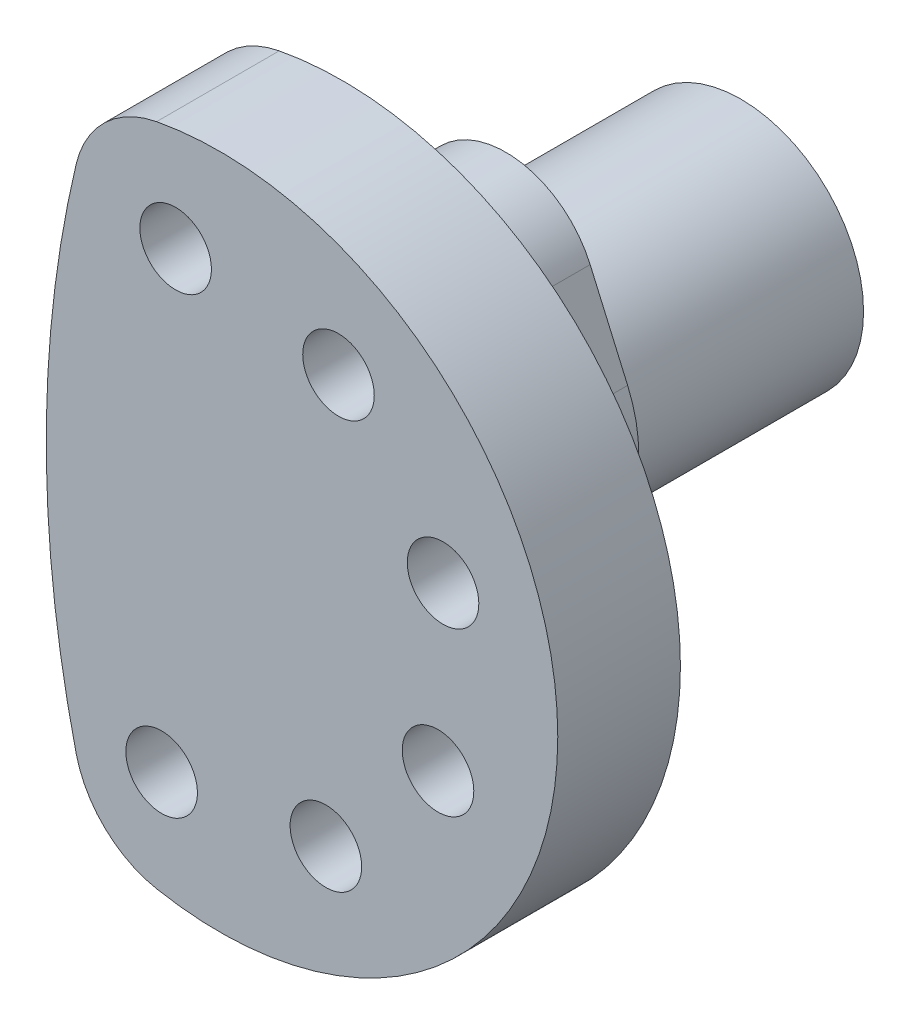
ISO-10303-21;
HEADER;
FILE_DESCRIPTION(('STEP AP214'),'2;1');
FILE_NAME('part.step','',(''),(''),'','','');
FILE_SCHEMA(('AUTOMOTIVE_DESIGN { 1 0 10303 214 1 1 1 1 }'));
ENDSEC;
DATA;
#1=APPLICATION_CONTEXT('core data for automotive mechanical design processes');
#2=APPLICATION_PROTOCOL_DEFINITION('international standard','automotive_design',2000,#1);
#3=PRODUCT_CONTEXT('',#1,'mechanical');
#4=PRODUCT('Part','Part','',(#3));
#5=PRODUCT_RELATED_PRODUCT_CATEGORY('part','',(#4));
#6=PRODUCT_DEFINITION_FORMATION('','',#4);
#7=PRODUCT_DEFINITION_CONTEXT('part definition',#1,'design');
#8=PRODUCT_DEFINITION('design','',#6,#7);
#9=PRODUCT_DEFINITION_SHAPE('','',#8);
#10=(LENGTH_UNIT() NAMED_UNIT(*) SI_UNIT(.MILLI.,.METRE.));
#11=(NAMED_UNIT(*) PLANE_ANGLE_UNIT() SI_UNIT($,.RADIAN.));
#12=(NAMED_UNIT(*) SI_UNIT($,.STERADIAN.) SOLID_ANGLE_UNIT());
#13=UNCERTAINTY_MEASURE_WITH_UNIT(LENGTH_MEASURE(1.E-05),#10,'distance_accuracy_value','');
#14=(GEOMETRIC_REPRESENTATION_CONTEXT(3) GLOBAL_UNCERTAINTY_ASSIGNED_CONTEXT((#13)) GLOBAL_UNIT_ASSIGNED_CONTEXT((#10,
#11,#12)) REPRESENTATION_CONTEXT('',''));
#15=CARTESIAN_POINT('',(0.,0.,0.));
#16=DIRECTION('',(0.,0.,1.));
#17=DIRECTION('',(1.,0.,0.));
#18=AXIS2_PLACEMENT_3D('',#15,#16,#17);
#19=CARTESIAN_POINT('',(0.,10.,-16.));
#20=DIRECTION('',(0.,0.,-1.));
#21=DIRECTION('',(-1.,0.,0.));
#22=AXIS2_PLACEMENT_3D('',#19,#20,#21);
#23=PLANE('',#22);
#24=DIRECTION('',(0.4,0.916515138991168,0.));
#25=VECTOR('',#24,1.);
#26=CARTESIAN_POINT('',(-11.9146968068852,5.2,-16.));
#27=LINE('',#26,#25);
#28=CARTESIAN_POINT('',(-11.9146968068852,5.2,-16.));
#29=VERTEX_POINT('',#28);
#30=CARTESIAN_POINT('',(-8.24863625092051,13.6,-16.));
#31=VERTEX_POINT('',#30);
#32=EDGE_CURVE('E118',#29,#31,#27,.T.);
#33=ORIENTED_EDGE('',*,*,#32,.T.);
#34=CARTESIAN_POINT('',(0.,10.,-16.));
#35=DIRECTION('',(0.,0.,-1.));
#36=DIRECTION('',(-1.,0.,0.));
#37=AXIS2_PLACEMENT_3D('',#34,#35,#36);
#38=CIRCLE('',#37,9.);
#39=CARTESIAN_POINT('',(8.24863625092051,13.6,-16.));
#40=VERTEX_POINT('',#39);
#41=EDGE_CURVE('E108',#31,#40,#38,.T.);
#42=ORIENTED_EDGE('',*,*,#41,.T.);
#43=DIRECTION('',(0.4,-0.916515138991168,0.));
#44=VECTOR('',#43,1.);
#45=CARTESIAN_POINT('',(8.24863625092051,13.6,-16.));
#46=LINE('',#45,#44);
#47=CARTESIAN_POINT('',(11.9146968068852,5.2,-16.));
#48=VERTEX_POINT('',#47);
#49=EDGE_CURVE('E117',#40,#48,#46,.T.);
#50=ORIENTED_EDGE('',*,*,#49,.T.);
#51=CARTESIAN_POINT('',(0.,0.,-16.));
#52=DIRECTION('',(0.,0.,1.));
#53=DIRECTION('',(1.,0.,0.));
#54=AXIS2_PLACEMENT_3D('',#51,#52,#53);
#55=CIRCLE('',#54,13.);
#56=EDGE_CURVE('E124',#29,#48,#55,.T.);
#57=ORIENTED_EDGE('',*,*,#56,.F.);
#58=EDGE_LOOP('',(#33,#42,#50,#57));
#59=FACE_BOUND('',#58,.T.);
#60=CARTESIAN_POINT('',(0.,0.,-16.));
#61=DIRECTION('',(0.,0.,-1.));
#62=DIRECTION('',(-1.,0.,0.));
#63=AXIS2_PLACEMENT_3D('',#60,#61,#62);
#64=CIRCLE('',#63,12.);
#65=CARTESIAN_POINT('',(-12.,0.,-16.));
#66=VERTEX_POINT('',#65);
#67=EDGE_CURVE('E282',#66,#66,#64,.T.);
#68=ORIENTED_EDGE('',*,*,#67,.F.);
#69=EDGE_LOOP('',(#68));
#70=FACE_BOUND('',#69,.T.);
#71=ADVANCED_FACE('F33',(#59,#70),#23,.T.);
#72=CARTESIAN_POINT('',(43.3619993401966,-11.337872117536,0.));
#73=DIRECTION('',(0.,0.,1.));
#74=DIRECTION('',(1.,0.,0.));
#75=AXIS2_PLACEMENT_3D('',#72,#73,#74);
#76=PLANE('',#75);
#77=CARTESIAN_POINT('',(91.0322485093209,0.,0.));
#78=DIRECTION('',(0.,0.,1.));
#79=DIRECTION('',(1.,0.,0.));
#80=AXIS2_PLACEMENT_3D('',#77,#78,#79);
#81=CIRCLE('',#80,108.);
#82=CARTESIAN_POINT('',(-14.0368721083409,24.9895956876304,0.));
#83=VERTEX_POINT('',#82);
#84=CARTESIAN_POINT('',(-14.0368721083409,-24.9895956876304,0.));
#85=VERTEX_POINT('',#84);
#86=EDGE_CURVE('E171',#83,#85,#81,.T.);
#87=ORIENTED_EDGE('',*,*,#86,.F.);
#88=CARTESIAN_POINT('',(-4.30824982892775,22.675744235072,0.));
#89=DIRECTION('',(0.,0.,1.));
#90=DIRECTION('',(-1.,0.,0.));
#91=AXIS2_PLACEMENT_3D('',#88,#89,#90);
#92=CIRCLE('',#91,9.99999999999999);
#93=CARTESIAN_POINT('',(-6.17479708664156,32.5,0.));
#94=VERTEX_POINT('',#93);
#95=EDGE_CURVE('E78',#94,#83,#92,.T.);
#96=ORIENTED_EDGE('',*,*,#95,.F.);
#97=CARTESIAN_POINT('',(0.,0.,0.));
#98=DIRECTION('',(0.,0.,1.));
#99=DIRECTION('',(1.,0.,0.));
#100=AXIS2_PLACEMENT_3D('',#97,#98,#99);
#101=CIRCLE('',#100,33.081386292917);
#102=CARTESIAN_POINT('',(-6.17479708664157,-32.5,0.));
#103=VERTEX_POINT('',#102);
#104=EDGE_CURVE('E185',#103,#94,#101,.T.);
#105=ORIENTED_EDGE('',*,*,#104,.F.);
#106=CARTESIAN_POINT('',(-4.30824982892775,-22.675744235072,0.));
#107=DIRECTION('',(0.,0.,1.));
#108=DIRECTION('',(1.,0.,0.));
#109=AXIS2_PLACEMENT_3D('',#106,#107,#108);
#110=CIRCLE('',#109,10.);
#111=EDGE_CURVE('E183',#85,#103,#110,.T.);
#112=ORIENTED_EDGE('',*,*,#111,.F.);
#113=EDGE_LOOP('',(#87,#96,#105,#112));
#114=FACE_BOUND('',#113,.T.);
#115=CARTESIAN_POINT('',(-4.30824982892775,22.675744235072,0.));
#116=DIRECTION('',(0.,0.,-1.));
#117=DIRECTION('',(-1.,0.,0.));
#118=AXIS2_PLACEMENT_3D('',#115,#116,#117);
#119=CIRCLE('',#118,3.5);
#120=CARTESIAN_POINT('',(-7.80824982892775,22.675744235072,0.));
#121=VERTEX_POINT('',#120);
#122=EDGE_CURVE('E168',#121,#121,#119,.T.);
#123=ORIENTED_EDGE('',*,*,#122,.F.);
#124=EDGE_LOOP('',(#123));
#125=FACE_BOUND('',#124,.T.);
#126=CARTESIAN_POINT('',(11.6251493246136,19.940067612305,0.));
#127=DIRECTION('',(0.,0.,-1.));
#128=DIRECTION('',(-0.754709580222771,0.656059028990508,0.));
#129=AXIS2_PLACEMENT_3D('',#126,#127,#128);
#130=CIRCLE('',#129,3.5);
#131=CARTESIAN_POINT('',(8.98366579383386,22.2362742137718,0.));
#132=VERTEX_POINT('',#131);
#133=EDGE_CURVE('E164',#132,#132,#130,.T.);
#134=ORIENTED_EDGE('',*,*,#133,.F.);
#135=EDGE_LOOP('',(#134));
#136=FACE_BOUND('',#135,.T.);
#137=CARTESIAN_POINT('',(21.85547296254,7.42217587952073,0.));
#138=DIRECTION('',(0.,0.,-1.));
#139=DIRECTION('',(-0.139173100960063,0.990268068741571,0.));
#140=AXIS2_PLACEMENT_3D('',#137,#138,#139);
#141=CIRCLE('',#140,3.5);
#142=CARTESIAN_POINT('',(21.3683671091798,10.8881141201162,0.));
#143=VERTEX_POINT('',#142);
#144=EDGE_CURVE('E158',#143,#143,#141,.T.);
#145=ORIENTED_EDGE('',*,*,#144,.F.);
#146=EDGE_LOOP('',(#145));
#147=FACE_BOUND('',#146,.T.);
#148=CARTESIAN_POINT('',(21.3639203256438,-8.73689312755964,0.));
#149=DIRECTION('',(0.,0.,-1.));
#150=DIRECTION('',(0.54463903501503,0.838670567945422,0.));
#151=AXIS2_PLACEMENT_3D('',#148,#149,#150);
#152=CIRCLE('',#151,3.5);
#153=CARTESIAN_POINT('',(23.2701569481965,-5.80154613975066,0.));
#154=VERTEX_POINT('',#153);
#155=EDGE_CURVE('E152',#154,#154,#152,.T.);
#156=ORIENTED_EDGE('',*,*,#155,.F.);
#157=EDGE_LOOP('',(#156));
#158=FACE_BOUND('',#157,.T.);
#159=CARTESIAN_POINT('',(10.3916377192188,-20.6098097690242,0.));
#160=DIRECTION('',(0.,0.,-1.));
#161=DIRECTION('',(0.96126169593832,0.275637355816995,0.));
#162=AXIS2_PLACEMENT_3D('',#159,#160,#161);
#163=CIRCLE('',#162,3.5);
#164=CARTESIAN_POINT('',(13.7560536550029,-19.6450790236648,0.));
#165=VERTEX_POINT('',#164);
#166=EDGE_CURVE('E146',#165,#165,#163,.T.);
#167=ORIENTED_EDGE('',*,*,#166,.F.);
#168=EDGE_LOOP('',(#167));
#169=FACE_BOUND('',#168,.T.);
#170=CARTESIAN_POINT('',(-5.67858324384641,-22.3719486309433,0.));
#171=DIRECTION('',(0.,0.,-1.));
#172=DIRECTION('',(0.906307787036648,-0.422618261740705,0.));
#173=AXIS2_PLACEMENT_3D('',#170,#171,#172);
#174=CIRCLE('',#173,3.5);
#175=CARTESIAN_POINT('',(-2.50650598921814,-23.8511125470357,0.));
#176=VERTEX_POINT('',#175);
#177=EDGE_CURVE('E135',#176,#176,#174,.T.);
#178=ORIENTED_EDGE('',*,*,#177,.F.);
#179=EDGE_LOOP('',(#178));
#180=FACE_BOUND('',#179,.T.);
#181=DIRECTION('',(0.4,0.916515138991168,0.));
#182=VECTOR('',#181,1.);
#183=CARTESIAN_POINT('',(-11.9146968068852,5.2,0.));
#184=LINE('',#183,#182);
#185=CARTESIAN_POINT('',(-11.9146968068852,5.2,0.));
#186=VERTEX_POINT('',#185);
#187=CARTESIAN_POINT('',(-8.24863625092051,13.6,0.));
#188=VERTEX_POINT('',#187);
#189=EDGE_CURVE('E130',#186,#188,#184,.T.);
#190=ORIENTED_EDGE('',*,*,#189,.F.);
#191=CARTESIAN_POINT('',(0.,0.,0.));
#192=DIRECTION('',(0.,0.,1.));
#193=DIRECTION('',(1.,0.,0.));
#194=AXIS2_PLACEMENT_3D('',#191,#192,#193);
#195=CIRCLE('',#194,13.);
#196=CARTESIAN_POINT('',(11.9146968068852,5.2,0.));
#197=VERTEX_POINT('',#196);
#198=EDGE_CURVE('E126',#186,#197,#195,.T.);
#199=ORIENTED_EDGE('',*,*,#198,.T.);
#200=DIRECTION('',(0.4,-0.916515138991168,0.));
#201=VECTOR('',#200,1.);
#202=CARTESIAN_POINT('',(8.24863625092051,13.6,0.));
#203=LINE('',#202,#201);
#204=CARTESIAN_POINT('',(8.24863625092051,13.6,0.));
#205=VERTEX_POINT('',#204);
#206=EDGE_CURVE('E48',#205,#197,#203,.T.);
#207=ORIENTED_EDGE('',*,*,#206,.F.);
#208=CARTESIAN_POINT('',(0.,10.,0.));
#209=DIRECTION('',(0.,0.,-1.));
#210=DIRECTION('',(-1.,0.,0.));
#211=AXIS2_PLACEMENT_3D('',#208,#209,#210);
#212=CIRCLE('',#211,9.);
#213=EDGE_CURVE('E277',#188,#205,#212,.T.);
#214=ORIENTED_EDGE('',*,*,#213,.F.);
#215=EDGE_LOOP('',(#190,#199,#207,#214));
#216=FACE_BOUND('',#215,.T.);
#217=ADVANCED_FACE('F198',(#114,#125,#136,#147,#158,#169,#180,#216),#76,.F.);
#218=CARTESIAN_POINT('',(91.0322485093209,0.,12.));
#219=DIRECTION('',(0.,0.,-1.));
#220=DIRECTION('',(-1.,0.,0.));
#221=AXIS2_PLACEMENT_3D('',#218,#219,#220);
#222=CYLINDRICAL_SURFACE('',#221,108.);
#223=ORIENTED_EDGE('',*,*,#86,.T.);
#224=DIRECTION('',(0.,0.,-1.));
#225=VECTOR('',#224,1.);
#226=CARTESIAN_POINT('',(-14.0368721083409,-24.9895956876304,12.));
#227=LINE('',#226,#225);
#228=CARTESIAN_POINT('',(-14.0368721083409,-24.9895956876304,12.));
#229=VERTEX_POINT('',#228);
#230=EDGE_CURVE('E11',#229,#85,#227,.T.);
#231=ORIENTED_EDGE('',*,*,#230,.F.);
#232=CARTESIAN_POINT('',(91.0322485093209,0.,12.));
#233=DIRECTION('',(0.,0.,1.));
#234=DIRECTION('',(1.,0.,0.));
#235=AXIS2_PLACEMENT_3D('',#232,#233,#234);
#236=CIRCLE('',#235,108.);
#237=CARTESIAN_POINT('',(-14.0368721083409,24.9895956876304,12.));
#238=VERTEX_POINT('',#237);
#239=EDGE_CURVE('E174',#238,#229,#236,.T.);
#240=ORIENTED_EDGE('',*,*,#239,.F.);
#241=DIRECTION('',(0.,0.,-1.));
#242=VECTOR('',#241,1.);
#243=CARTESIAN_POINT('',(-14.0368721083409,24.9895956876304,12.));
#244=LINE('',#243,#242);
#245=EDGE_CURVE('E180',#238,#83,#244,.T.);
#246=ORIENTED_EDGE('',*,*,#245,.T.);
#247=EDGE_LOOP('',(#223,#231,#240,#246));
#248=FACE_BOUND('',#247,.T.);
#249=ADVANCED_FACE('F35',(#248),#222,.T.);
#250=CARTESIAN_POINT('',(-4.30824982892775,-22.675744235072,12.));
#251=DIRECTION('',(0.,0.,-1.));
#252=DIRECTION('',(-1.,0.,0.));
#253=AXIS2_PLACEMENT_3D('',#250,#251,#252);
#254=CYLINDRICAL_SURFACE('',#253,10.);
#255=ORIENTED_EDGE('',*,*,#111,.T.);
#256=DIRECTION('',(0.,0.,-1.));
#257=VECTOR('',#256,1.);
#258=CARTESIAN_POINT('',(-6.17479708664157,-32.5,12.));
#259=LINE('',#258,#257);
#260=CARTESIAN_POINT('',(-6.17479708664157,-32.5,12.));
#261=VERTEX_POINT('',#260);
#262=EDGE_CURVE('E41',#261,#103,#259,.T.);
#263=ORIENTED_EDGE('',*,*,#262,.F.);
#264=CARTESIAN_POINT('',(-4.30824982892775,-22.675744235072,12.));
#265=DIRECTION('',(0.,0.,1.));
#266=DIRECTION('',(1.,0.,0.));
#267=AXIS2_PLACEMENT_3D('',#264,#265,#266);
#268=CIRCLE('',#267,10.);
#269=EDGE_CURVE('E85',#229,#261,#268,.T.);
#270=ORIENTED_EDGE('',*,*,#269,.F.);
#271=ORIENTED_EDGE('',*,*,#230,.T.);
#272=EDGE_LOOP('',(#255,#263,#270,#271));
#273=FACE_BOUND('',#272,.T.);
#274=ADVANCED_FACE('F214',(#273),#254,.T.);
#275=CARTESIAN_POINT('',(0.,0.,12.));
#276=DIRECTION('',(0.,0.,-1.));
#277=DIRECTION('',(-1.,0.,0.));
#278=AXIS2_PLACEMENT_3D('',#275,#276,#277);
#279=CYLINDRICAL_SURFACE('',#278,33.081386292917);
#280=ORIENTED_EDGE('',*,*,#104,.T.);
#281=DIRECTION('',(0.,0.,-1.));
#282=VECTOR('',#281,1.);
#283=CARTESIAN_POINT('',(-6.17479708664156,32.5,12.));
#284=LINE('',#283,#282);
#285=CARTESIAN_POINT('',(-6.17479708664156,32.5,12.));
#286=VERTEX_POINT('',#285);
#287=EDGE_CURVE('E189',#286,#94,#284,.T.);
#288=ORIENTED_EDGE('',*,*,#287,.F.);
#289=CARTESIAN_POINT('',(0.,0.,12.));
#290=DIRECTION('',(0.,0.,1.));
#291=DIRECTION('',(1.,0.,0.));
#292=AXIS2_PLACEMENT_3D('',#289,#290,#291);
#293=CIRCLE('',#292,33.081386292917);
#294=EDGE_CURVE('E177',#261,#286,#293,.T.);
#295=ORIENTED_EDGE('',*,*,#294,.F.);
#296=ORIENTED_EDGE('',*,*,#262,.T.);
#297=EDGE_LOOP('',(#280,#288,#295,#296));
#298=FACE_BOUND('',#297,.T.);
#299=ADVANCED_FACE('F194',(#298),#279,.T.);
#300=CARTESIAN_POINT('',(-4.30824982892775,22.675744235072,12.));
#301=DIRECTION('',(0.,0.,-1.));
#302=DIRECTION('',(-1.,0.,0.));
#303=AXIS2_PLACEMENT_3D('',#300,#301,#302);
#304=CYLINDRICAL_SURFACE('',#303,9.99999999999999);
#305=ORIENTED_EDGE('',*,*,#95,.T.);
#306=ORIENTED_EDGE('',*,*,#245,.F.);
#307=CARTESIAN_POINT('',(-4.30824982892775,22.675744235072,12.));
#308=DIRECTION('',(0.,0.,1.));
#309=DIRECTION('',(-1.,0.,0.));
#310=AXIS2_PLACEMENT_3D('',#307,#308,#309);
#311=CIRCLE('',#310,9.99999999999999);
#312=EDGE_CURVE('E57',#286,#238,#311,.T.);
#313=ORIENTED_EDGE('',*,*,#312,.F.);
#314=ORIENTED_EDGE('',*,*,#287,.T.);
#315=EDGE_LOOP('',(#305,#306,#313,#314));
#316=FACE_BOUND('',#315,.T.);
#317=ADVANCED_FACE('F203',(#316),#304,.T.);
#318=CARTESIAN_POINT('',(43.3619993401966,-11.337872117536,12.));
#319=DIRECTION('',(0.,0.,1.));
#320=DIRECTION('',(1.,0.,0.));
#321=AXIS2_PLACEMENT_3D('',#318,#319,#320);
#322=PLANE('',#321);
#323=CARTESIAN_POINT('',(-5.67858324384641,-22.3719486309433,12.));
#324=DIRECTION('',(0.,0.,1.));
#325=DIRECTION('',(-0.906307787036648,0.422618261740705,0.));
#326=AXIS2_PLACEMENT_3D('',#323,#324,#325);
#327=CIRCLE('',#326,3.5);
#328=CARTESIAN_POINT('',(-8.85066049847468,-20.8927847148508,12.));
#329=VERTEX_POINT('',#328);
#330=EDGE_CURVE('E132',#329,#329,#327,.F.);
#331=ORIENTED_EDGE('',*,*,#330,.T.);
#332=EDGE_LOOP('',(#331));
#333=FACE_BOUND('',#332,.T.);
#334=CARTESIAN_POINT('',(10.3916377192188,-20.6098097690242,12.));
#335=DIRECTION('',(0.,0.,1.));
#336=DIRECTION('',(-0.96126169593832,-0.275637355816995,0.));
#337=AXIS2_PLACEMENT_3D('',#334,#335,#336);
#338=CIRCLE('',#337,3.5);
#339=CARTESIAN_POINT('',(7.02722178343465,-21.5745405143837,12.));
#340=VERTEX_POINT('',#339);
#341=EDGE_CURVE('E143',#340,#340,#338,.F.);
#342=ORIENTED_EDGE('',*,*,#341,.T.);
#343=EDGE_LOOP('',(#342));
#344=FACE_BOUND('',#343,.T.);
#345=CARTESIAN_POINT('',(21.3639203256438,-8.73689312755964,12.));
#346=DIRECTION('',(0.,0.,1.));
#347=DIRECTION('',(-0.54463903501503,-0.838670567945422,0.));
#348=AXIS2_PLACEMENT_3D('',#345,#346,#347);
#349=CIRCLE('',#348,3.5);
#350=CARTESIAN_POINT('',(19.4576837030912,-11.6722401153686,12.));
#351=VERTEX_POINT('',#350);
#352=EDGE_CURVE('E149',#351,#351,#349,.F.);
#353=ORIENTED_EDGE('',*,*,#352,.T.);
#354=EDGE_LOOP('',(#353));
#355=FACE_BOUND('',#354,.T.);
#356=CARTESIAN_POINT('',(21.85547296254,7.42217587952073,12.));
#357=DIRECTION('',(0.,0.,1.));
#358=DIRECTION('',(0.139173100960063,-0.990268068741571,0.));
#359=AXIS2_PLACEMENT_3D('',#356,#357,#358);
#360=CIRCLE('',#359,3.5);
#361=CARTESIAN_POINT('',(22.3425788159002,3.95623763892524,12.));
#362=VERTEX_POINT('',#361);
#363=EDGE_CURVE('E155',#362,#362,#360,.F.);
#364=ORIENTED_EDGE('',*,*,#363,.T.);
#365=EDGE_LOOP('',(#364));
#366=FACE_BOUND('',#365,.T.);
#367=CARTESIAN_POINT('',(11.6251493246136,19.940067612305,12.));
#368=DIRECTION('',(0.,0.,1.));
#369=DIRECTION('',(0.754709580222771,-0.656059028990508,0.));
#370=AXIS2_PLACEMENT_3D('',#367,#368,#369);
#371=CIRCLE('',#370,3.5);
#372=CARTESIAN_POINT('',(14.2666328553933,17.6438610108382,12.));
#373=VERTEX_POINT('',#372);
#374=EDGE_CURVE('E161',#373,#373,#371,.F.);
#375=ORIENTED_EDGE('',*,*,#374,.T.);
#376=EDGE_LOOP('',(#375));
#377=FACE_BOUND('',#376,.T.);
#378=CARTESIAN_POINT('',(-4.30824982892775,22.675744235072,12.));
#379=DIRECTION('',(0.,0.,1.));
#380=DIRECTION('',(1.,0.,0.));
#381=AXIS2_PLACEMENT_3D('',#378,#379,#380);
#382=CIRCLE('',#381,3.5);
#383=CARTESIAN_POINT('',(-0.808249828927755,22.675744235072,12.));
#384=VERTEX_POINT('',#383);
#385=EDGE_CURVE('E167',#384,#384,#382,.F.);
#386=ORIENTED_EDGE('',*,*,#385,.T.);
#387=EDGE_LOOP('',(#386));
#388=FACE_BOUND('',#387,.T.);
#389=ORIENTED_EDGE('',*,*,#239,.T.);
#390=ORIENTED_EDGE('',*,*,#269,.T.);
#391=ORIENTED_EDGE('',*,*,#294,.T.);
#392=ORIENTED_EDGE('',*,*,#312,.T.);
#393=EDGE_LOOP('',(#389,#390,#391,#392));
#394=FACE_BOUND('',#393,.T.);
#395=ADVANCED_FACE('F205',(#333,#344,#355,#366,#377,#388,#394),#322,.T.);
#396=CARTESIAN_POINT('',(-4.30824982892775,22.675744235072,12.001));
#397=DIRECTION('',(0.,0.,-1.));
#398=DIRECTION('',(-1.,0.,0.));
#399=AXIS2_PLACEMENT_3D('',#396,#397,#398);
#400=CYLINDRICAL_SURFACE('',#399,3.5);
#401=ORIENTED_EDGE('',*,*,#385,.F.);
#402=EDGE_LOOP('',(#401));
#403=FACE_BOUND('',#402,.T.);
#404=ORIENTED_EDGE('',*,*,#122,.T.);
#405=EDGE_LOOP('',(#404));
#406=FACE_BOUND('',#405,.T.);
#407=ADVANCED_FACE('F211',(#403,#406),#400,.F.);
#408=CARTESIAN_POINT('',(11.6251493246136,19.940067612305,12.001));
#409=DIRECTION('',(0.,0.,-1.));
#410=DIRECTION('',(-0.754709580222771,0.656059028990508,0.));
#411=AXIS2_PLACEMENT_3D('',#408,#409,#410);
#412=CYLINDRICAL_SURFACE('',#411,3.5);
#413=ORIENTED_EDGE('',*,*,#374,.F.);
#414=EDGE_LOOP('',(#413));
#415=FACE_BOUND('',#414,.T.);
#416=ORIENTED_EDGE('',*,*,#133,.T.);
#417=EDGE_LOOP('',(#416));
#418=FACE_BOUND('',#417,.T.);
#419=ADVANCED_FACE('F252',(#415,#418),#412,.F.);
#420=CARTESIAN_POINT('',(21.85547296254,7.42217587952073,12.001));
#421=DIRECTION('',(0.,0.,-1.));
#422=DIRECTION('',(-0.139173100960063,0.990268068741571,0.));
#423=AXIS2_PLACEMENT_3D('',#420,#421,#422);
#424=CYLINDRICAL_SURFACE('',#423,3.5);
#425=ORIENTED_EDGE('',*,*,#363,.F.);
#426=EDGE_LOOP('',(#425));
#427=FACE_BOUND('',#426,.T.);
#428=ORIENTED_EDGE('',*,*,#144,.T.);
#429=EDGE_LOOP('',(#428));
#430=FACE_BOUND('',#429,.T.);
#431=ADVANCED_FACE('F248',(#427,#430),#424,.F.);
#432=CARTESIAN_POINT('',(21.3639203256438,-8.73689312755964,12.001));
#433=DIRECTION('',(0.,0.,-1.));
#434=DIRECTION('',(0.54463903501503,0.838670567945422,0.));
#435=AXIS2_PLACEMENT_3D('',#432,#433,#434);
#436=CYLINDRICAL_SURFACE('',#435,3.5);
#437=ORIENTED_EDGE('',*,*,#352,.F.);
#438=EDGE_LOOP('',(#437));
#439=FACE_BOUND('',#438,.T.);
#440=ORIENTED_EDGE('',*,*,#155,.T.);
#441=EDGE_LOOP('',(#440));
#442=FACE_BOUND('',#441,.T.);
#443=ADVANCED_FACE('F244',(#439,#442),#436,.F.);
#444=CARTESIAN_POINT('',(10.3916377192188,-20.6098097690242,12.001));
#445=DIRECTION('',(0.,0.,-1.));
#446=DIRECTION('',(0.96126169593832,0.275637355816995,0.));
#447=AXIS2_PLACEMENT_3D('',#444,#445,#446);
#448=CYLINDRICAL_SURFACE('',#447,3.5);
#449=ORIENTED_EDGE('',*,*,#341,.F.);
#450=EDGE_LOOP('',(#449));
#451=FACE_BOUND('',#450,.T.);
#452=ORIENTED_EDGE('',*,*,#166,.T.);
#453=EDGE_LOOP('',(#452));
#454=FACE_BOUND('',#453,.T.);
#455=ADVANCED_FACE('F240',(#451,#454),#448,.F.);
#456=CARTESIAN_POINT('',(-5.67858324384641,-22.3719486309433,12.001));
#457=DIRECTION('',(0.,0.,-1.));
#458=DIRECTION('',(0.906307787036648,-0.422618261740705,0.));
#459=AXIS2_PLACEMENT_3D('',#456,#457,#458);
#460=CYLINDRICAL_SURFACE('',#459,3.5);
#461=ORIENTED_EDGE('',*,*,#330,.F.);
#462=EDGE_LOOP('',(#461));
#463=FACE_BOUND('',#462,.T.);
#464=ORIENTED_EDGE('',*,*,#177,.T.);
#465=EDGE_LOOP('',(#464));
#466=FACE_BOUND('',#465,.T.);
#467=ADVANCED_FACE('F237',(#463,#466),#460,.F.);
#468=CARTESIAN_POINT('',(-11.9146968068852,5.2,-16.));
#469=DIRECTION('',(0.916515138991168,-0.4,0.));
#470=DIRECTION('',(0.4,0.916515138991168,0.));
#471=AXIS2_PLACEMENT_3D('',#468,#469,#470);
#472=PLANE('',#471);
#473=ORIENTED_EDGE('',*,*,#189,.T.);
#474=DIRECTION('',(0.,0.,1.));
#475=VECTOR('',#474,1.);
#476=CARTESIAN_POINT('',(-8.24863625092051,13.6,-16.));
#477=LINE('',#476,#475);
#478=EDGE_CURVE('E112',#31,#188,#477,.T.);
#479=ORIENTED_EDGE('',*,*,#478,.F.);
#480=ORIENTED_EDGE('',*,*,#32,.F.);
#481=DIRECTION('',(0.,0.,1.));
#482=VECTOR('',#481,1.);
#483=CARTESIAN_POINT('',(-11.9146968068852,5.2,-16.));
#484=LINE('',#483,#482);
#485=EDGE_CURVE('E289',#29,#186,#484,.T.);
#486=ORIENTED_EDGE('',*,*,#485,.T.);
#487=EDGE_LOOP('',(#473,#479,#480,#486));
#488=FACE_BOUND('',#487,.T.);
#489=ADVANCED_FACE('F128',(#488),#472,.F.);
#490=CARTESIAN_POINT('',(0.,10.,-16.));
#491=DIRECTION('',(0.,0.,1.));
#492=DIRECTION('',(1.,0.,0.));
#493=AXIS2_PLACEMENT_3D('',#490,#491,#492);
#494=CYLINDRICAL_SURFACE('',#493,9.);
#495=ORIENTED_EDGE('',*,*,#213,.T.);
#496=DIRECTION('',(0.,0.,1.));
#497=VECTOR('',#496,1.);
#498=CARTESIAN_POINT('',(8.24863625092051,13.6,-16.));
#499=LINE('',#498,#497);
#500=EDGE_CURVE('E114',#40,#205,#499,.T.);
#501=ORIENTED_EDGE('',*,*,#500,.F.);
#502=ORIENTED_EDGE('',*,*,#41,.F.);
#503=ORIENTED_EDGE('',*,*,#478,.T.);
#504=EDGE_LOOP('',(#495,#501,#502,#503));
#505=FACE_BOUND('',#504,.T.);
#506=ADVANCED_FACE('F110',(#505),#494,.T.);
#507=CARTESIAN_POINT('',(8.24863625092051,13.6,-16.));
#508=DIRECTION('',(-0.916515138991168,-0.4,0.));
#509=DIRECTION('',(0.4,-0.916515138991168,0.));
#510=AXIS2_PLACEMENT_3D('',#507,#508,#509);
#511=PLANE('',#510);
#512=ORIENTED_EDGE('',*,*,#206,.T.);
#513=DIRECTION('',(0.,0.,1.));
#514=VECTOR('',#513,1.);
#515=CARTESIAN_POINT('',(11.9146968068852,5.2,-16.));
#516=LINE('',#515,#514);
#517=EDGE_CURVE('E137',#48,#197,#516,.T.);
#518=ORIENTED_EDGE('',*,*,#517,.F.);
#519=ORIENTED_EDGE('',*,*,#49,.F.);
#520=ORIENTED_EDGE('',*,*,#500,.T.);
#521=EDGE_LOOP('',(#512,#518,#519,#520));
#522=FACE_BOUND('',#521,.T.);
#523=ADVANCED_FACE('F229',(#522),#511,.F.);
#524=CARTESIAN_POINT('',(0.,0.,-16.));
#525=DIRECTION('',(0.,0.,1.));
#526=DIRECTION('',(1.,0.,0.));
#527=AXIS2_PLACEMENT_3D('',#524,#525,#526);
#528=CYLINDRICAL_SURFACE('',#527,13.);
#529=ORIENTED_EDGE('',*,*,#198,.F.);
#530=ORIENTED_EDGE('',*,*,#485,.F.);
#531=ORIENTED_EDGE('',*,*,#56,.T.);
#532=ORIENTED_EDGE('',*,*,#517,.T.);
#533=EDGE_LOOP('',(#529,#530,#531,#532));
#534=FACE_BOUND('',#533,.T.);
#535=ADVANCED_FACE('F226',(#534),#528,.T.);
#536=CARTESIAN_POINT('',(0.,0.,-39.));
#537=DIRECTION('',(0.,0.,1.));
#538=DIRECTION('',(1.,0.,0.));
#539=AXIS2_PLACEMENT_3D('',#536,#537,#538);
#540=CYLINDRICAL_SURFACE('',#539,12.);
#541=CARTESIAN_POINT('',(0.,0.,-39.));
#542=DIRECTION('',(0.,0.,-1.));
#543=DIRECTION('',(-1.,0.,0.));
#544=AXIS2_PLACEMENT_3D('',#541,#542,#543);
#545=CIRCLE('',#544,12.);
#546=CARTESIAN_POINT('',(-12.,0.,-39.));
#547=VERTEX_POINT('',#546);
#548=EDGE_CURVE('E278',#547,#547,#545,.T.);
#549=ORIENTED_EDGE('',*,*,#548,.F.);
#550=EDGE_LOOP('',(#549));
#551=FACE_BOUND('',#550,.T.);
#552=ORIENTED_EDGE('',*,*,#67,.T.);
#553=EDGE_LOOP('',(#552));
#554=FACE_BOUND('',#553,.T.);
#555=ADVANCED_FACE('F224',(#551,#554),#540,.T.);
#556=CARTESIAN_POINT('',(0.,0.,-39.));
#557=DIRECTION('',(0.,0.,-1.));
#558=DIRECTION('',(-1.,0.,0.));
#559=AXIS2_PLACEMENT_3D('',#556,#557,#558);
#560=PLANE('',#559);
#561=ORIENTED_EDGE('',*,*,#548,.T.);
#562=EDGE_LOOP('',(#561));
#563=FACE_BOUND('',#562,.T.);
#564=ADVANCED_FACE('F295',(#563),#560,.T.);
#565=CLOSED_SHELL('',(#71,#217,#249,#274,#299,#317,#395,#407,#419,#431,#443,#455,#467,#489,#506,
#523,#535,#555,#564));
#566=MANIFOLD_SOLID_BREP('B2',#565);
#567=ADVANCED_BREP_SHAPE_REPRESENTATION('',(#18,#566),#14);
#568=SHAPE_DEFINITION_REPRESENTATION(#9,#567);
ENDSEC;
END-ISO-10303-21;
